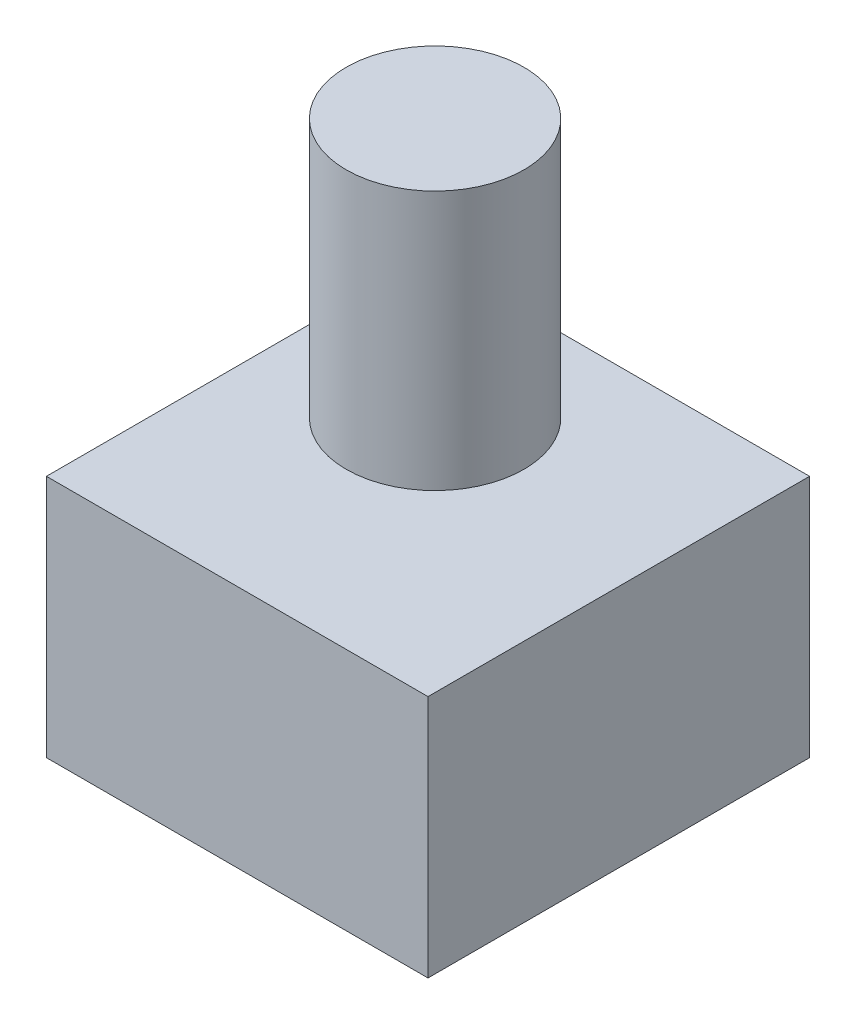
from build123d import *

# Parameters (mm, degrees)
SKETCH1_W      = 97.52724138
SKETCH1_H      = 97.52724138
EXTRUDE1_DEPTH = 62.290520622
SKETCH2_R      = 22.723416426
EXTRUDE2_DEPTH = 66.296473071


with BuildPart() as part:
    # Sketch1 → Extrude1 (new body)
    with BuildSketch(Plane(origin=(0, 0, 0), x_dir=(1, 0, 0), z_dir=(0, 1, 0))):
        Rectangle(SKETCH1_W, SKETCH1_H)
    extrude(amount=EXTRUDE1_DEPTH)

    # Sketch2 → Extrude2 (add)
    with BuildSketch(Plane(origin=(0, 62.290520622, 0), x_dir=(-1, 0, 0), z_dir=(0, 1, 0))):
        with Locations(Location((11.992039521, -13.805144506, 0), (0, 0, 90))):
            Circle(SKETCH2_R)
    extrude(amount=EXTRUDE2_DEPTH)


solid = part.part
